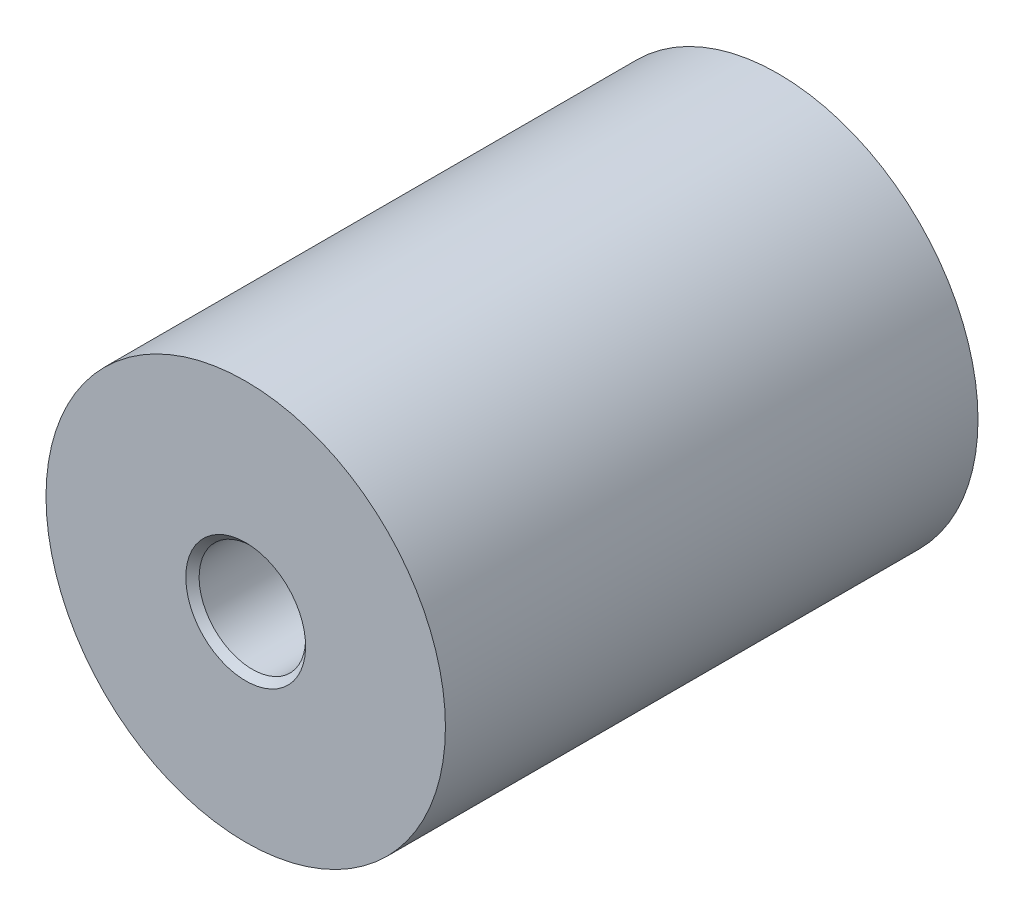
ISO-10303-21;
HEADER;
FILE_DESCRIPTION(('STEP AP214'),'2;1');
FILE_NAME('part.step','',(''),(''),'','','');
FILE_SCHEMA(('AUTOMOTIVE_DESIGN { 1 0 10303 214 1 1 1 1 }'));
ENDSEC;
DATA;
#1=APPLICATION_CONTEXT('core data for automotive mechanical design processes');
#2=APPLICATION_PROTOCOL_DEFINITION('international standard','automotive_design',2000,#1);
#3=PRODUCT_CONTEXT('',#1,'mechanical');
#4=PRODUCT('Part','Part','',(#3));
#5=PRODUCT_RELATED_PRODUCT_CATEGORY('part','',(#4));
#6=PRODUCT_DEFINITION_FORMATION('','',#4);
#7=PRODUCT_DEFINITION_CONTEXT('part definition',#1,'design');
#8=PRODUCT_DEFINITION('design','',#6,#7);
#9=PRODUCT_DEFINITION_SHAPE('','',#8);
#10=(LENGTH_UNIT() NAMED_UNIT(*) SI_UNIT(.MILLI.,.METRE.));
#11=(NAMED_UNIT(*) PLANE_ANGLE_UNIT() SI_UNIT($,.RADIAN.));
#12=(NAMED_UNIT(*) SI_UNIT($,.STERADIAN.) SOLID_ANGLE_UNIT());
#13=UNCERTAINTY_MEASURE_WITH_UNIT(LENGTH_MEASURE(1.E-05),#10,'distance_accuracy_value','');
#14=(GEOMETRIC_REPRESENTATION_CONTEXT(3) GLOBAL_UNCERTAINTY_ASSIGNED_CONTEXT((#13)) GLOBAL_UNIT_ASSIGNED_CONTEXT((#10,
#11,#12)) REPRESENTATION_CONTEXT('',''));
#15=CARTESIAN_POINT('',(0.,0.,0.));
#16=DIRECTION('',(0.,0.,1.));
#17=DIRECTION('',(1.,0.,0.));
#18=AXIS2_PLACEMENT_3D('',#15,#16,#17);
#19=CARTESIAN_POINT('',(0.,0.,0.66666666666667));
#20=DIRECTION('',(0.,0.,1.));
#21=DIRECTION('',(0.,-1.,0.));
#22=AXIS2_PLACEMENT_3D('',#19,#20,#21);
#23=CYLINDRICAL_SURFACE('',#22,15.);
#24=CARTESIAN_POINT('',(0.,0.,0.));
#25=DIRECTION('',(0.,0.,1.));
#26=DIRECTION('',(0.,-1.,0.));
#27=AXIS2_PLACEMENT_3D('',#24,#25,#26);
#28=CIRCLE('',#27,15.);
#29=CARTESIAN_POINT('',(0.,-15.,0.));
#30=VERTEX_POINT('',#29);
#31=EDGE_CURVE('E23',#30,#30,#28,.T.);
#32=ORIENTED_EDGE('',*,*,#31,.T.);
#33=EDGE_LOOP('',(#32));
#34=FACE_BOUND('',#33,.T.);
#35=CARTESIAN_POINT('',(0.,0.,40.));
#36=DIRECTION('',(0.,0.,-1.));
#37=DIRECTION('',(0.,1.,0.));
#38=AXIS2_PLACEMENT_3D('',#35,#36,#37);
#39=CIRCLE('',#38,15.);
#40=CARTESIAN_POINT('',(0.,15.,40.));
#41=VERTEX_POINT('',#40);
#42=EDGE_CURVE('E32',#41,#41,#39,.T.);
#43=ORIENTED_EDGE('',*,*,#42,.T.);
#44=EDGE_LOOP('',(#43));
#45=FACE_BOUND('',#44,.T.);
#46=ADVANCED_FACE('F12',(#34,#45),#23,.T.);
#47=CARTESIAN_POINT('',(15.,0.,0.));
#48=DIRECTION('',(0.,0.,-1.));
#49=DIRECTION('',(0.,1.,0.));
#50=AXIS2_PLACEMENT_3D('',#47,#48,#49);
#51=PLANE('',#50);
#52=CARTESIAN_POINT('',(0.,0.,0.));
#53=DIRECTION('',(0.,0.,-1.));
#54=DIRECTION('',(0.,1.,0.));
#55=AXIS2_PLACEMENT_3D('',#52,#53,#54);
#56=CIRCLE('',#55,4.5);
#57=CARTESIAN_POINT('',(0.,4.5,0.));
#58=VERTEX_POINT('',#57);
#59=EDGE_CURVE('E8',#58,#58,#56,.F.);
#60=ORIENTED_EDGE('',*,*,#59,.T.);
#61=EDGE_LOOP('',(#60));
#62=FACE_BOUND('',#61,.T.);
#63=ORIENTED_EDGE('',*,*,#31,.F.);
#64=EDGE_LOOP('',(#63));
#65=FACE_BOUND('',#64,.T.);
#66=ADVANCED_FACE('F58',(#62,#65),#51,.T.);
#67=CARTESIAN_POINT('',(0.,0.,0.));
#68=DIRECTION('',(0.,0.,1.));
#69=DIRECTION('',(0.,-1.,0.));
#70=AXIS2_PLACEMENT_3D('',#67,#68,#69);
#71=CYLINDRICAL_SURFACE('',#70,4.);
#72=CARTESIAN_POINT('',(0.,0.,0.5));
#73=DIRECTION('',(0.,0.,-1.));
#74=DIRECTION('',(0.,1.,0.));
#75=AXIS2_PLACEMENT_3D('',#72,#73,#74);
#76=CIRCLE('',#75,4.);
#77=CARTESIAN_POINT('',(0.,4.,0.5));
#78=VERTEX_POINT('',#77);
#79=EDGE_CURVE('E19',#78,#78,#76,.T.);
#80=ORIENTED_EDGE('',*,*,#79,.T.);
#81=EDGE_LOOP('',(#80));
#82=FACE_BOUND('',#81,.T.);
#83=CARTESIAN_POINT('',(0.,0.,8.));
#84=DIRECTION('',(0.,0.,-1.));
#85=DIRECTION('',(0.,1.,0.));
#86=AXIS2_PLACEMENT_3D('',#83,#84,#85);
#87=CIRCLE('',#86,4.);
#88=CARTESIAN_POINT('',(0.,4.,8.));
#89=VERTEX_POINT('',#88);
#90=EDGE_CURVE('E27',#89,#89,#87,.T.);
#91=ORIENTED_EDGE('',*,*,#90,.F.);
#92=EDGE_LOOP('',(#91));
#93=FACE_BOUND('',#92,.T.);
#94=ADVANCED_FACE('F63',(#82,#93),#71,.F.);
#95=CARTESIAN_POINT('',(0.,0.,8.));
#96=DIRECTION('',(0.,0.,-1.));
#97=DIRECTION('',(0.,1.,0.));
#98=AXIS2_PLACEMENT_3D('',#95,#96,#97);
#99=PLANE('',#98);
#100=ORIENTED_EDGE('',*,*,#90,.T.);
#101=EDGE_LOOP('',(#100));
#102=FACE_BOUND('',#101,.T.);
#103=ADVANCED_FACE('F69',(#102),#99,.T.);
#104=CARTESIAN_POINT('',(0.,0.,0.5));
#105=DIRECTION('',(0.,0.,-1.));
#106=DIRECTION('',(0.,1.,0.));
#107=AXIS2_PLACEMENT_3D('',#104,#105,#106);
#108=CONICAL_SURFACE('',#107,4.,0.785398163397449);
#109=ORIENTED_EDGE('',*,*,#59,.F.);
#110=EDGE_LOOP('',(#109));
#111=FACE_BOUND('',#110,.T.);
#112=ORIENTED_EDGE('',*,*,#79,.F.);
#113=EDGE_LOOP('',(#112));
#114=FACE_BOUND('',#113,.T.);
#115=ADVANCED_FACE('F14',(#111,#114),#108,.F.);
#116=CARTESIAN_POINT('',(15.,0.,40.));
#117=DIRECTION('',(0.,0.,1.));
#118=DIRECTION('',(0.,-1.,0.));
#119=AXIS2_PLACEMENT_3D('',#116,#117,#118);
#120=PLANE('',#119);
#121=CARTESIAN_POINT('',(0.,0.,40.));
#122=DIRECTION('',(0.,0.,-1.));
#123=DIRECTION('',(0.,1.,0.));
#124=AXIS2_PLACEMENT_3D('',#121,#122,#123);
#125=CIRCLE('',#124,4.5);
#126=CARTESIAN_POINT('',(0.,4.5,40.));
#127=VERTEX_POINT('',#126);
#128=EDGE_CURVE('E35',#127,#127,#125,.T.);
#129=ORIENTED_EDGE('',*,*,#128,.T.);
#130=EDGE_LOOP('',(#129));
#131=FACE_BOUND('',#130,.T.);
#132=ORIENTED_EDGE('',*,*,#42,.F.);
#133=EDGE_LOOP('',(#132));
#134=FACE_BOUND('',#133,.T.);
#135=ADVANCED_FACE('F73',(#131,#134),#120,.T.);
#136=CARTESIAN_POINT('',(0.,0.,40.));
#137=DIRECTION('',(0.,0.,1.));
#138=DIRECTION('',(0.,-1.,0.));
#139=AXIS2_PLACEMENT_3D('',#136,#137,#138);
#140=CONICAL_SURFACE('',#139,4.5,0.785398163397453);
#141=CARTESIAN_POINT('',(0.,0.,39.5));
#142=DIRECTION('',(0.,0.,-1.));
#143=DIRECTION('',(0.,1.,0.));
#144=AXIS2_PLACEMENT_3D('',#141,#142,#143);
#145=CIRCLE('',#144,4.);
#146=CARTESIAN_POINT('',(0.,4.,39.5));
#147=VERTEX_POINT('',#146);
#148=EDGE_CURVE('E38',#147,#147,#145,.T.);
#149=ORIENTED_EDGE('',*,*,#148,.T.);
#150=EDGE_LOOP('',(#149));
#151=FACE_BOUND('',#150,.T.);
#152=ORIENTED_EDGE('',*,*,#128,.F.);
#153=EDGE_LOOP('',(#152));
#154=FACE_BOUND('',#153,.T.);
#155=ADVANCED_FACE('F55',(#151,#154),#140,.F.);
#156=CARTESIAN_POINT('',(0.,0.,0.));
#157=DIRECTION('',(0.,0.,-1.));
#158=DIRECTION('',(0.,1.,0.));
#159=AXIS2_PLACEMENT_3D('',#156,#157,#158);
#160=CYLINDRICAL_SURFACE('',#159,4.);
#161=CARTESIAN_POINT('',(0.,0.,32.));
#162=DIRECTION('',(0.,0.,-1.));
#163=DIRECTION('',(0.,1.,0.));
#164=AXIS2_PLACEMENT_3D('',#161,#162,#163);
#165=CIRCLE('',#164,4.);
#166=CARTESIAN_POINT('',(0.,4.,32.));
#167=VERTEX_POINT('',#166);
#168=EDGE_CURVE('E41',#167,#167,#165,.T.);
#169=ORIENTED_EDGE('',*,*,#168,.T.);
#170=EDGE_LOOP('',(#169));
#171=FACE_BOUND('',#170,.T.);
#172=ORIENTED_EDGE('',*,*,#148,.F.);
#173=EDGE_LOOP('',(#172));
#174=FACE_BOUND('',#173,.T.);
#175=ADVANCED_FACE('F45',(#171,#174),#160,.F.);
#176=CARTESIAN_POINT('',(4.,0.,32.));
#177=DIRECTION('',(0.,0.,1.));
#178=DIRECTION('',(0.,-1.,0.));
#179=AXIS2_PLACEMENT_3D('',#176,#177,#178);
#180=PLANE('',#179);
#181=ORIENTED_EDGE('',*,*,#168,.F.);
#182=EDGE_LOOP('',(#181));
#183=FACE_BOUND('',#182,.T.);
#184=ADVANCED_FACE('F48',(#183),#180,.T.);
#185=CLOSED_SHELL('',(#46,#66,#94,#103,#115,#135,#155,#175,#184));
#186=MANIFOLD_SOLID_BREP('B1',#185);
#187=ADVANCED_BREP_SHAPE_REPRESENTATION('',(#18,#186),#14);
#188=SHAPE_DEFINITION_REPRESENTATION(#9,#187);
ENDSEC;
END-ISO-10303-21;
